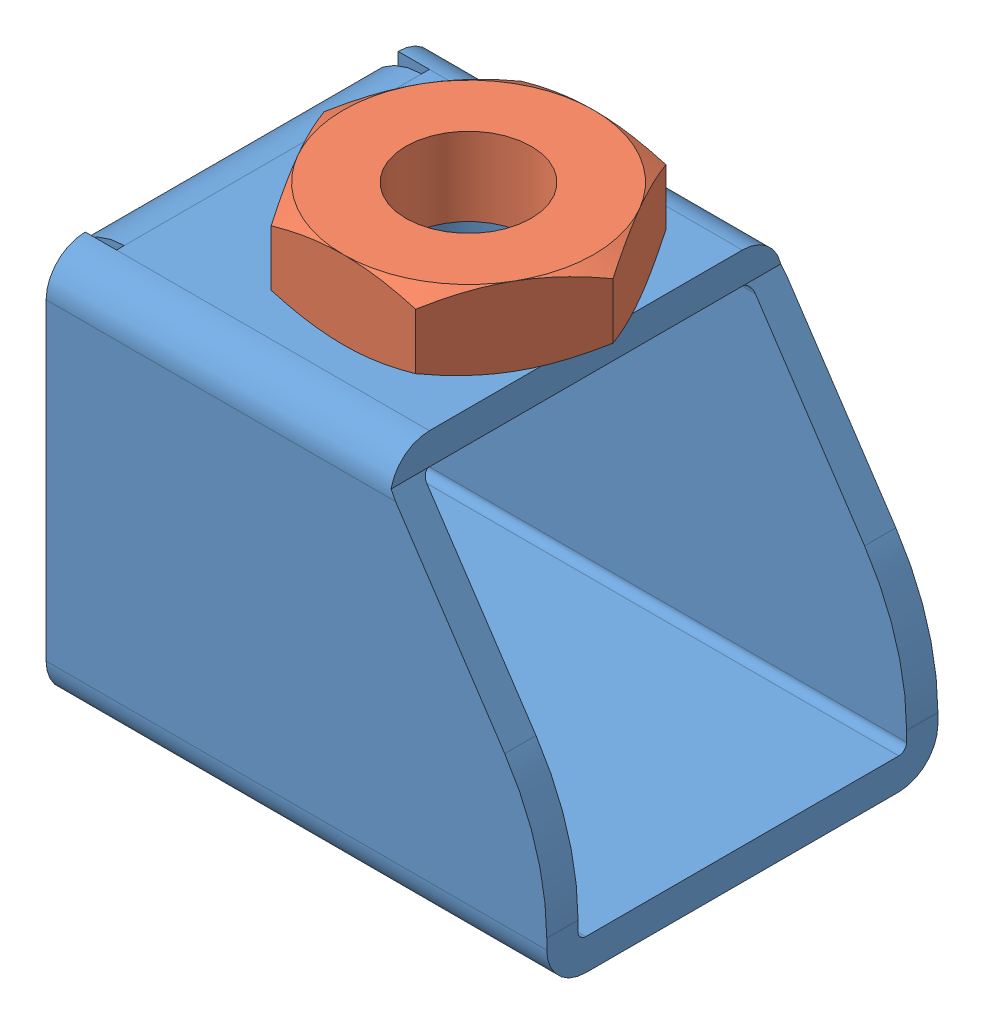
SolidWorks assembly Carré de verrouillage 25x25x2-Lg32-écrou M10.SLDASM, configuration Défaut (file format 7000). Lengths in mm.
Overall size (34 30 25).
2 component instances, 2 part files, 3 mates.
Components (placement in the parent):
- Carré de verrouillage 25x25x2-Lg32-1: Carré de verrouillage 25x25x2-Lg32.SLDPRT [Défaut] at origin size (34 25 25)
- Ecrou hexagonal HM - M10-1: Ecrou hexagonal HM - M10.SLDPRT [Défaut] at (14.5 12.5 0) x (0 0 1) z (0 -1 0) size (16 18.48 5)
Mates (geometry in assembly coordinates):
- Coaxiale1: concentric anti-aligned: cylinder of Carré de verrouillage 25x25x2-Lg32-1 through (14.5 -12.501 0) axis (0 1 0) radius 4.5; cylinder of Ecrou hexagonal HM - M10-1 through (14.5 31.6421 0) axis (0 -1 0) radius 4
- Coïncidente1: coincident anti-aligned: plane of Carré de verrouillage 25x25x2-Lg32-1 through (32 12.5 10) normal (0 1 0); plane of Ecrou hexagonal HM - M10-1 through (0.6436 12.5 -8) normal (0 -1 0)
- Parallèle1: parallel aligned: plane of Carré de verrouillage 25x25x2-Lg32-1 through (32 10 12.5) normal (0 0 1); plane of Ecrou hexagonal HM - M10-1 through (19.1188 17.5 8) normal (0 0 1)
